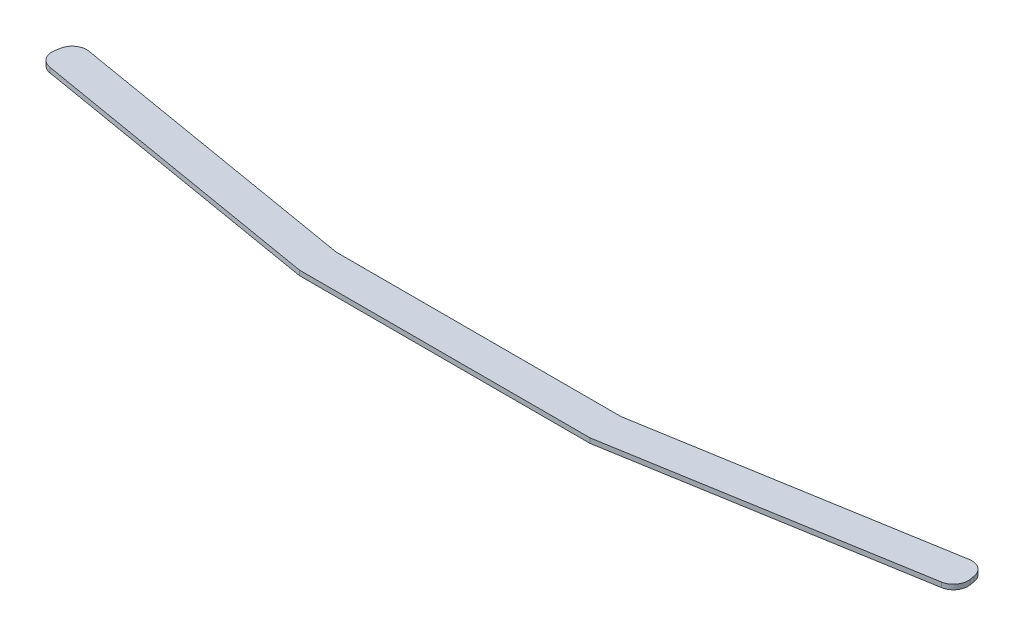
ISO-10303-21;
HEADER;
FILE_DESCRIPTION(('STEP AP214'),'2;1');
FILE_NAME('part.step','',(''),(''),'','','');
FILE_SCHEMA(('AUTOMOTIVE_DESIGN { 1 0 10303 214 1 1 1 1 }'));
ENDSEC;
DATA;
#1=APPLICATION_CONTEXT('core data for automotive mechanical design processes');
#2=APPLICATION_PROTOCOL_DEFINITION('international standard','automotive_design',2000,#1);
#3=PRODUCT_CONTEXT('',#1,'mechanical');
#4=PRODUCT('Part','Part','',(#3));
#5=PRODUCT_RELATED_PRODUCT_CATEGORY('part','',(#4));
#6=PRODUCT_DEFINITION_FORMATION('','',#4);
#7=PRODUCT_DEFINITION_CONTEXT('part definition',#1,'design');
#8=PRODUCT_DEFINITION('design','',#6,#7);
#9=PRODUCT_DEFINITION_SHAPE('','',#8);
#10=(LENGTH_UNIT() NAMED_UNIT(*) SI_UNIT(.MILLI.,.METRE.));
#11=(NAMED_UNIT(*) PLANE_ANGLE_UNIT() SI_UNIT($,.RADIAN.));
#12=(NAMED_UNIT(*) SI_UNIT($,.STERADIAN.) SOLID_ANGLE_UNIT());
#13=UNCERTAINTY_MEASURE_WITH_UNIT(LENGTH_MEASURE(1.E-05),#10,'distance_accuracy_value','');
#14=(GEOMETRIC_REPRESENTATION_CONTEXT(3) GLOBAL_UNCERTAINTY_ASSIGNED_CONTEXT((#13)) GLOBAL_UNIT_ASSIGNED_CONTEXT((#10,
#11,#12)) REPRESENTATION_CONTEXT('',''));
#15=CARTESIAN_POINT('',(0.,0.,0.));
#16=DIRECTION('',(0.,0.,1.));
#17=DIRECTION('',(1.,0.,0.));
#18=AXIS2_PLACEMENT_3D('',#15,#16,#17);
#19=CARTESIAN_POINT('',(29.9999999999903,1.,0.));
#20=DIRECTION('',(-0.166858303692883,0.,-0.985980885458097));
#21=DIRECTION('',(-0.985980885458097,0.,0.166858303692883));
#22=AXIS2_PLACEMENT_3D('',#19,#20,#21);
#23=PLANE('',#22);
#24=DIRECTION('',(0.985980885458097,0.,-0.166858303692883));
#25=VECTOR('',#24,1.);
#26=CARTESIAN_POINT('',(29.9999999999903,0.,0.));
#27=LINE('',#26,#25);
#28=CARTESIAN_POINT('',(29.9999999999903,0.,0.));
#29=VERTEX_POINT('',#28);
#30=CARTESIAN_POINT('',(92.0420573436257,0.,-10.4994250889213));
#31=VERTEX_POINT('',#30);
#32=EDGE_CURVE('E153',#29,#31,#27,.T.);
#33=ORIENTED_EDGE('',*,*,#32,.T.);
#34=DIRECTION('',(0.,-1.,0.));
#35=VECTOR('',#34,1.);
#36=CARTESIAN_POINT('',(92.0420573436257,1.,-10.4994250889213));
#37=LINE('',#36,#35);
#38=CARTESIAN_POINT('',(92.0420573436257,1.,-10.4994250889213));
#39=VERTEX_POINT('',#38);
#40=EDGE_CURVE('E11',#39,#31,#37,.T.);
#41=ORIENTED_EDGE('',*,*,#40,.F.);
#42=DIRECTION('',(0.985980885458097,0.,-0.166858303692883));
#43=VECTOR('',#42,1.);
#44=CARTESIAN_POINT('',(29.9999999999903,1.,0.));
#45=LINE('',#44,#43);
#46=CARTESIAN_POINT('',(29.9999999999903,1.,0.));
#47=VERTEX_POINT('',#46);
#48=EDGE_CURVE('E175',#47,#39,#45,.T.);
#49=ORIENTED_EDGE('',*,*,#48,.F.);
#50=DIRECTION('',(0.,-1.,0.));
#51=VECTOR('',#50,1.);
#52=CARTESIAN_POINT('',(29.9999999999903,1.,0.));
#53=LINE('',#52,#51);
#54=EDGE_CURVE('E149',#47,#29,#53,.T.);
#55=ORIENTED_EDGE('',*,*,#54,.T.);
#56=EDGE_LOOP('',(#33,#41,#49,#55));
#57=FACE_BOUND('',#56,.T.);
#58=ADVANCED_FACE('F33',(#57),#23,.F.);
#59=CARTESIAN_POINT('',(91.541482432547,1.,-13.4573677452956));
#60=DIRECTION('',(0.,-1.,0.));
#61=DIRECTION('',(0.,0.,-1.));
#62=AXIS2_PLACEMENT_3D('',#59,#60,#61);
#63=CYLINDRICAL_SURFACE('',#62,2.99999999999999);
#64=CARTESIAN_POINT('',(91.541482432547,0.,-13.4573677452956));
#65=DIRECTION('',(0.,1.,0.));
#66=DIRECTION('',(0.,0.,1.));
#67=AXIS2_PLACEMENT_3D('',#64,#65,#66);
#68=CIRCLE('',#67,2.99999999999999);
#69=CARTESIAN_POINT('',(94.4994250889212,0.,-13.9579426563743));
#70=VERTEX_POINT('',#69);
#71=EDGE_CURVE('E156',#31,#70,#68,.T.);
#72=ORIENTED_EDGE('',*,*,#71,.T.);
#73=DIRECTION('',(0.,-1.,0.));
#74=VECTOR('',#73,1.);
#75=CARTESIAN_POINT('',(94.4994250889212,1.,-13.9579426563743));
#76=LINE('',#75,#74);
#77=CARTESIAN_POINT('',(94.4994250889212,1.,-13.9579426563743));
#78=VERTEX_POINT('',#77);
#79=EDGE_CURVE('E41',#78,#70,#76,.T.);
#80=ORIENTED_EDGE('',*,*,#79,.F.);
#81=CARTESIAN_POINT('',(91.541482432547,1.,-13.4573677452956));
#82=DIRECTION('',(0.,1.,0.));
#83=DIRECTION('',(0.,0.,1.));
#84=AXIS2_PLACEMENT_3D('',#81,#82,#83);
#85=CIRCLE('',#84,2.99999999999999);
#86=EDGE_CURVE('E104',#39,#78,#85,.T.);
#87=ORIENTED_EDGE('',*,*,#86,.F.);
#88=ORIENTED_EDGE('',*,*,#40,.T.);
#89=EDGE_LOOP('',(#72,#80,#87,#88));
#90=FACE_BOUND('',#89,.T.);
#91=ADVANCED_FACE('F253',(#90),#63,.T.);
#92=CARTESIAN_POINT('',(94.4994250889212,1.,-13.9579426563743));
#93=DIRECTION('',(-0.985980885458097,0.,0.166858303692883));
#94=DIRECTION('',(0.166858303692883,0.,0.985980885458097));
#95=AXIS2_PLACEMENT_3D('',#92,#93,#94);
#96=PLANE('',#95);
#97=DIRECTION('',(-0.166858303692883,0.,-0.985980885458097));
#98=VECTOR('',#97,1.);
#99=CARTESIAN_POINT('',(94.4994250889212,0.,-13.9579426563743));
#100=LINE('',#99,#98);
#101=CARTESIAN_POINT('',(94.3325667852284,0.,-14.9439235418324));
#102=VERTEX_POINT('',#101);
#103=EDGE_CURVE('E158',#70,#102,#100,.T.);
#104=ORIENTED_EDGE('',*,*,#103,.T.);
#105=DIRECTION('',(0.,-1.,0.));
#106=VECTOR('',#105,1.);
#107=CARTESIAN_POINT('',(94.3325667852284,1.,-14.9439235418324));
#108=LINE('',#107,#106);
#109=CARTESIAN_POINT('',(94.3325667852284,1.,-14.9439235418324));
#110=VERTEX_POINT('',#109);
#111=EDGE_CURVE('E194',#110,#102,#108,.T.);
#112=ORIENTED_EDGE('',*,*,#111,.F.);
#113=DIRECTION('',(-0.166858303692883,0.,-0.985980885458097));
#114=VECTOR('',#113,1.);
#115=CARTESIAN_POINT('',(94.4994250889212,1.,-13.9579426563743));
#116=LINE('',#115,#114);
#117=EDGE_CURVE('E202',#78,#110,#116,.T.);
#118=ORIENTED_EDGE('',*,*,#117,.F.);
#119=ORIENTED_EDGE('',*,*,#79,.T.);
#120=EDGE_LOOP('',(#104,#112,#118,#119));
#121=FACE_BOUND('',#120,.T.);
#122=ADVANCED_FACE('F200',(#121),#96,.F.);
#123=CARTESIAN_POINT('',(91.3746241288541,1.,-14.4433486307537));
#124=DIRECTION('',(0.,-1.,0.));
#125=DIRECTION('',(0.,0.,-1.));
#126=AXIS2_PLACEMENT_3D('',#123,#124,#125);
#127=CYLINDRICAL_SURFACE('',#126,3.);
#128=CARTESIAN_POINT('',(91.3746241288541,0.,-14.4433486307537));
#129=DIRECTION('',(0.,1.,0.));
#130=DIRECTION('',(0.,0.,1.));
#131=AXIS2_PLACEMENT_3D('',#128,#129,#130);
#132=CIRCLE('',#131,3.);
#133=CARTESIAN_POINT('',(90.8740492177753,0.,-17.4012912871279));
#134=VERTEX_POINT('',#133);
#135=EDGE_CURVE('E160',#102,#134,#132,.T.);
#136=ORIENTED_EDGE('',*,*,#135,.T.);
#137=DIRECTION('',(0.,-1.,0.));
#138=VECTOR('',#137,1.);
#139=CARTESIAN_POINT('',(90.8740492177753,1.,-17.4012912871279));
#140=LINE('',#139,#138);
#141=CARTESIAN_POINT('',(90.8740492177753,1.,-17.4012912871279));
#142=VERTEX_POINT('',#141);
#143=EDGE_CURVE('E191',#142,#134,#140,.T.);
#144=ORIENTED_EDGE('',*,*,#143,.F.);
#145=CARTESIAN_POINT('',(91.3746241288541,1.,-14.4433486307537));
#146=DIRECTION('',(0.,1.,0.));
#147=DIRECTION('',(0.,0.,1.));
#148=AXIS2_PLACEMENT_3D('',#145,#146,#147);
#149=CIRCLE('',#148,3.);
#150=EDGE_CURVE('E220',#110,#142,#149,.T.);
#151=ORIENTED_EDGE('',*,*,#150,.F.);
#152=ORIENTED_EDGE('',*,*,#111,.T.);
#153=EDGE_LOOP('',(#136,#144,#151,#152));
#154=FACE_BOUND('',#153,.T.);
#155=ADVANCED_FACE('F211',(#154),#127,.T.);
#156=CARTESIAN_POINT('',(29.4118734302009,1.,-7.00000000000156));
#157=DIRECTION('',(0.166858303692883,0.,0.985980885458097));
#158=DIRECTION('',(0.985980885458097,0.,-0.166858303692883));
#159=AXIS2_PLACEMENT_3D('',#156,#157,#158);
#160=PLANE('',#159);
#161=DIRECTION('',(-0.985980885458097,0.,0.166858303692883));
#162=VECTOR('',#161,1.);
#163=CARTESIAN_POINT('',(29.4118734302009,0.,-7.00000000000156));
#164=LINE('',#163,#162);
#165=CARTESIAN_POINT('',(29.4118734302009,0.,-7.00000000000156));
#166=VERTEX_POINT('',#165);
#167=EDGE_CURVE('E162',#134,#166,#164,.T.);
#168=ORIENTED_EDGE('',*,*,#167,.T.);
#169=DIRECTION('',(0.,-1.,0.));
#170=VECTOR('',#169,1.);
#171=CARTESIAN_POINT('',(29.4118734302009,1.,-7.00000000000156));
#172=LINE('',#171,#170);
#173=CARTESIAN_POINT('',(29.4118734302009,1.,-7.00000000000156));
#174=VERTEX_POINT('',#173);
#175=EDGE_CURVE('E188',#174,#166,#172,.T.);
#176=ORIENTED_EDGE('',*,*,#175,.F.);
#177=DIRECTION('',(-0.985980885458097,0.,0.166858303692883));
#178=VECTOR('',#177,1.);
#179=CARTESIAN_POINT('',(29.4118734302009,1.,-7.00000000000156));
#180=LINE('',#179,#178);
#181=EDGE_CURVE('E217',#142,#174,#180,.T.);
#182=ORIENTED_EDGE('',*,*,#181,.F.);
#183=ORIENTED_EDGE('',*,*,#143,.T.);
#184=EDGE_LOOP('',(#168,#176,#182,#183));
#185=FACE_BOUND('',#184,.T.);
#186=ADVANCED_FACE('F215',(#185),#160,.F.);
#187=CARTESIAN_POINT('',(-29.4118734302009,1.,-7.00000000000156));
#188=DIRECTION('',(0.,0.,1.));
#189=DIRECTION('',(1.,0.,0.));
#190=AXIS2_PLACEMENT_3D('',#187,#188,#189);
#191=PLANE('',#190);
#192=DIRECTION('',(-1.,0.,0.));
#193=VECTOR('',#192,1.);
#194=CARTESIAN_POINT('',(-29.4118734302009,0.,-7.00000000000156));
#195=LINE('',#194,#193);
#196=CARTESIAN_POINT('',(-29.4118734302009,0.,-7.00000000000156));
#197=VERTEX_POINT('',#196);
#198=EDGE_CURVE('E164',#166,#197,#195,.T.);
#199=ORIENTED_EDGE('',*,*,#198,.T.);
#200=DIRECTION('',(0.,-1.,0.));
#201=VECTOR('',#200,1.);
#202=CARTESIAN_POINT('',(-29.4118734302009,1.,-7.00000000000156));
#203=LINE('',#202,#201);
#204=CARTESIAN_POINT('',(-29.4118734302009,1.,-7.00000000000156));
#205=VERTEX_POINT('',#204);
#206=EDGE_CURVE('E185',#205,#197,#203,.T.);
#207=ORIENTED_EDGE('',*,*,#206,.F.);
#208=DIRECTION('',(-1.,0.,0.));
#209=VECTOR('',#208,1.);
#210=CARTESIAN_POINT('',(-29.4118734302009,1.,-7.00000000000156));
#211=LINE('',#210,#209);
#212=EDGE_CURVE('E219',#174,#205,#211,.T.);
#213=ORIENTED_EDGE('',*,*,#212,.F.);
#214=ORIENTED_EDGE('',*,*,#175,.T.);
#215=EDGE_LOOP('',(#199,#207,#213,#214));
#216=FACE_BOUND('',#215,.T.);
#217=ADVANCED_FACE('F266',(#216),#191,.F.);
#218=CARTESIAN_POINT('',(-29.4118734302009,1.,-7.00000000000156));
#219=DIRECTION('',(-0.166858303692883,0.,0.985980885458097));
#220=DIRECTION('',(0.985980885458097,0.,0.166858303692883));
#221=AXIS2_PLACEMENT_3D('',#218,#219,#220);
#222=PLANE('',#221);
#223=DIRECTION('',(-0.985980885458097,0.,-0.166858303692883));
#224=VECTOR('',#223,1.);
#225=CARTESIAN_POINT('',(-29.4118734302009,0.,-7.00000000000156));
#226=LINE('',#225,#224);
#227=CARTESIAN_POINT('',(-90.8740492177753,0.,-17.4012912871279));
#228=VERTEX_POINT('',#227);
#229=EDGE_CURVE('E166',#197,#228,#226,.T.);
#230=ORIENTED_EDGE('',*,*,#229,.T.);
#231=DIRECTION('',(0.,-1.,0.));
#232=VECTOR('',#231,1.);
#233=CARTESIAN_POINT('',(-90.8740492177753,1.,-17.4012912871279));
#234=LINE('',#233,#232);
#235=CARTESIAN_POINT('',(-90.8740492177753,1.,-17.4012912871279));
#236=VERTEX_POINT('',#235);
#237=EDGE_CURVE('E182',#236,#228,#234,.T.);
#238=ORIENTED_EDGE('',*,*,#237,.F.);
#239=DIRECTION('',(-0.985980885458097,0.,-0.166858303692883));
#240=VECTOR('',#239,1.);
#241=CARTESIAN_POINT('',(-29.4118734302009,1.,-7.00000000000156));
#242=LINE('',#241,#240);
#243=EDGE_CURVE('E222',#205,#236,#242,.T.);
#244=ORIENTED_EDGE('',*,*,#243,.F.);
#245=ORIENTED_EDGE('',*,*,#206,.T.);
#246=EDGE_LOOP('',(#230,#238,#244,#245));
#247=FACE_BOUND('',#246,.T.);
#248=ADVANCED_FACE('F269',(#247),#222,.F.);
#249=CARTESIAN_POINT('',(-91.3746241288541,1.,-14.4433486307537));
#250=DIRECTION('',(0.,-1.,0.));
#251=DIRECTION('',(0.,0.,-1.));
#252=AXIS2_PLACEMENT_3D('',#249,#250,#251);
#253=CYLINDRICAL_SURFACE('',#252,3.);
#254=CARTESIAN_POINT('',(-91.3746241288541,0.,-14.4433486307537));
#255=DIRECTION('',(0.,1.,0.));
#256=DIRECTION('',(0.,0.,-1.));
#257=AXIS2_PLACEMENT_3D('',#254,#255,#256);
#258=CIRCLE('',#257,3.);
#259=CARTESIAN_POINT('',(-94.3325667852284,0.,-14.9439235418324));
#260=VERTEX_POINT('',#259);
#261=EDGE_CURVE('E168',#228,#260,#258,.T.);
#262=ORIENTED_EDGE('',*,*,#261,.T.);
#263=DIRECTION('',(0.,-1.,0.));
#264=VECTOR('',#263,1.);
#265=CARTESIAN_POINT('',(-94.3325667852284,1.,-14.9439235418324));
#266=LINE('',#265,#264);
#267=CARTESIAN_POINT('',(-94.3325667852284,1.,-14.9439235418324));
#268=VERTEX_POINT('',#267);
#269=EDGE_CURVE('E179',#268,#260,#266,.T.);
#270=ORIENTED_EDGE('',*,*,#269,.F.);
#271=CARTESIAN_POINT('',(-91.3746241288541,1.,-14.4433486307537));
#272=DIRECTION('',(0.,1.,0.));
#273=DIRECTION('',(0.,0.,-1.));
#274=AXIS2_PLACEMENT_3D('',#271,#272,#273);
#275=CIRCLE('',#274,3.);
#276=EDGE_CURVE('E228',#236,#268,#275,.T.);
#277=ORIENTED_EDGE('',*,*,#276,.F.);
#278=ORIENTED_EDGE('',*,*,#237,.T.);
#279=EDGE_LOOP('',(#262,#270,#277,#278));
#280=FACE_BOUND('',#279,.T.);
#281=ADVANCED_FACE('F234',(#280),#253,.T.);
#282=CARTESIAN_POINT('',(-94.4994250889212,1.,-13.9579426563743));
#283=DIRECTION('',(0.985980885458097,0.,0.166858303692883));
#284=DIRECTION('',(0.166858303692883,0.,-0.985980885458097));
#285=AXIS2_PLACEMENT_3D('',#282,#283,#284);
#286=PLANE('',#285);
#287=DIRECTION('',(-0.166858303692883,0.,0.985980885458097));
#288=VECTOR('',#287,1.);
#289=CARTESIAN_POINT('',(-94.4994250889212,0.,-13.9579426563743));
#290=LINE('',#289,#288);
#291=CARTESIAN_POINT('',(-94.4994250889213,0.,-13.9579426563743));
#292=VERTEX_POINT('',#291);
#293=EDGE_CURVE('E170',#260,#292,#290,.T.);
#294=ORIENTED_EDGE('',*,*,#293,.T.);
#295=DIRECTION('',(0.,-1.,0.));
#296=VECTOR('',#295,1.);
#297=CARTESIAN_POINT('',(-94.4994250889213,1.,-13.9579426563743));
#298=LINE('',#297,#296);
#299=CARTESIAN_POINT('',(-94.4994250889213,1.,-13.9579426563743));
#300=VERTEX_POINT('',#299);
#301=EDGE_CURVE('E144',#300,#292,#298,.T.);
#302=ORIENTED_EDGE('',*,*,#301,.F.);
#303=DIRECTION('',(-0.166858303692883,0.,0.985980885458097));
#304=VECTOR('',#303,1.);
#305=CARTESIAN_POINT('',(-94.4994250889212,1.,-13.9579426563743));
#306=LINE('',#305,#304);
#307=EDGE_CURVE('E135',#268,#300,#306,.T.);
#308=ORIENTED_EDGE('',*,*,#307,.F.);
#309=ORIENTED_EDGE('',*,*,#269,.T.);
#310=EDGE_LOOP('',(#294,#302,#308,#309));
#311=FACE_BOUND('',#310,.T.);
#312=ADVANCED_FACE('F238',(#311),#286,.F.);
#313=CARTESIAN_POINT('',(-91.541482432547,1.,-13.4573677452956));
#314=DIRECTION('',(0.,-1.,0.));
#315=DIRECTION('',(0.,0.,-1.));
#316=AXIS2_PLACEMENT_3D('',#313,#314,#315);
#317=CYLINDRICAL_SURFACE('',#316,2.99999999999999);
#318=CARTESIAN_POINT('',(-91.541482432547,0.,-13.4573677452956));
#319=DIRECTION('',(0.,1.,0.));
#320=DIRECTION('',(0.,0.,-1.));
#321=AXIS2_PLACEMENT_3D('',#318,#319,#320);
#322=CIRCLE('',#321,2.99999999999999);
#323=CARTESIAN_POINT('',(-92.0420573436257,0.,-10.4994250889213));
#324=VERTEX_POINT('',#323);
#325=EDGE_CURVE('E143',#292,#324,#322,.T.);
#326=ORIENTED_EDGE('',*,*,#325,.T.);
#327=DIRECTION('',(0.,-1.,0.));
#328=VECTOR('',#327,1.);
#329=CARTESIAN_POINT('',(-92.0420573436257,1.,-10.4994250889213));
#330=LINE('',#329,#328);
#331=CARTESIAN_POINT('',(-92.0420573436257,1.,-10.4994250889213));
#332=VERTEX_POINT('',#331);
#333=EDGE_CURVE('E140',#332,#324,#330,.T.);
#334=ORIENTED_EDGE('',*,*,#333,.F.);
#335=CARTESIAN_POINT('',(-91.541482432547,1.,-13.4573677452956));
#336=DIRECTION('',(0.,1.,0.));
#337=DIRECTION('',(0.,0.,-1.));
#338=AXIS2_PLACEMENT_3D('',#335,#336,#337);
#339=CIRCLE('',#338,2.99999999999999);
#340=EDGE_CURVE('E129',#300,#332,#339,.T.);
#341=ORIENTED_EDGE('',*,*,#340,.F.);
#342=ORIENTED_EDGE('',*,*,#301,.T.);
#343=EDGE_LOOP('',(#326,#334,#341,#342));
#344=FACE_BOUND('',#343,.T.);
#345=ADVANCED_FACE('F141',(#344),#317,.T.);
#346=CARTESIAN_POINT('',(-29.9999999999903,1.,0.));
#347=DIRECTION('',(0.166858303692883,0.,-0.985980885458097));
#348=DIRECTION('',(-0.985980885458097,0.,-0.166858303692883));
#349=AXIS2_PLACEMENT_3D('',#346,#347,#348);
#350=PLANE('',#349);
#351=DIRECTION('',(0.985980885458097,0.,0.166858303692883));
#352=VECTOR('',#351,1.);
#353=CARTESIAN_POINT('',(-29.9999999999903,0.,0.));
#354=LINE('',#353,#352);
#355=CARTESIAN_POINT('',(-29.9999999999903,0.,0.));
#356=VERTEX_POINT('',#355);
#357=EDGE_CURVE('E90',#324,#356,#354,.T.);
#358=ORIENTED_EDGE('',*,*,#357,.T.);
#359=DIRECTION('',(0.,-1.,0.));
#360=VECTOR('',#359,1.);
#361=CARTESIAN_POINT('',(-29.9999999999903,1.,0.));
#362=LINE('',#361,#360);
#363=CARTESIAN_POINT('',(-29.9999999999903,1.,0.));
#364=VERTEX_POINT('',#363);
#365=EDGE_CURVE('E145',#364,#356,#362,.T.);
#366=ORIENTED_EDGE('',*,*,#365,.F.);
#367=DIRECTION('',(0.985980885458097,0.,0.166858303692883));
#368=VECTOR('',#367,1.);
#369=CARTESIAN_POINT('',(-29.9999999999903,1.,0.));
#370=LINE('',#369,#368);
#371=EDGE_CURVE('E133',#332,#364,#370,.T.);
#372=ORIENTED_EDGE('',*,*,#371,.F.);
#373=ORIENTED_EDGE('',*,*,#333,.T.);
#374=EDGE_LOOP('',(#358,#366,#372,#373));
#375=FACE_BOUND('',#374,.T.);
#376=ADVANCED_FACE('F147',(#375),#350,.F.);
#377=CARTESIAN_POINT('',(-29.9999999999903,1.,0.));
#378=DIRECTION('',(0.,0.,-1.));
#379=DIRECTION('',(-1.,0.,0.));
#380=AXIS2_PLACEMENT_3D('',#377,#378,#379);
#381=PLANE('',#380);
#382=DIRECTION('',(1.,0.,0.));
#383=VECTOR('',#382,1.);
#384=CARTESIAN_POINT('',(-29.9999999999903,0.,0.));
#385=LINE('',#384,#383);
#386=EDGE_CURVE('E96',#356,#29,#385,.T.);
#387=ORIENTED_EDGE('',*,*,#386,.T.);
#388=ORIENTED_EDGE('',*,*,#54,.F.);
#389=DIRECTION('',(1.,0.,0.));
#390=VECTOR('',#389,1.);
#391=CARTESIAN_POINT('',(-29.9999999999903,1.,0.));
#392=LINE('',#391,#390);
#393=EDGE_CURVE('E49',#364,#47,#392,.T.);
#394=ORIENTED_EDGE('',*,*,#393,.F.);
#395=ORIENTED_EDGE('',*,*,#365,.T.);
#396=EDGE_LOOP('',(#387,#388,#394,#395));
#397=FACE_BOUND('',#396,.T.);
#398=ADVANCED_FACE('F242',(#397),#381,.F.);
#399=CARTESIAN_POINT('',(91.541482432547,1.,-13.4573677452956));
#400=DIRECTION('',(0.,1.,0.));
#401=DIRECTION('',(0.,0.,1.));
#402=AXIS2_PLACEMENT_3D('',#399,#400,#401);
#403=PLANE('',#402);
#404=ORIENTED_EDGE('',*,*,#48,.T.);
#405=ORIENTED_EDGE('',*,*,#86,.T.);
#406=ORIENTED_EDGE('',*,*,#117,.T.);
#407=ORIENTED_EDGE('',*,*,#150,.T.);
#408=ORIENTED_EDGE('',*,*,#181,.T.);
#409=ORIENTED_EDGE('',*,*,#212,.T.);
#410=ORIENTED_EDGE('',*,*,#243,.T.);
#411=ORIENTED_EDGE('',*,*,#276,.T.);
#412=ORIENTED_EDGE('',*,*,#307,.T.);
#413=ORIENTED_EDGE('',*,*,#340,.T.);
#414=ORIENTED_EDGE('',*,*,#371,.T.);
#415=ORIENTED_EDGE('',*,*,#393,.T.);
#416=EDGE_LOOP('',(#404,#405,#406,#407,#408,#409,#410,#411,#412,#413,#414,#415));
#417=FACE_BOUND('',#416,.T.);
#418=ADVANCED_FACE('F131',(#417),#403,.T.);
#419=CARTESIAN_POINT('',(91.541482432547,0.,-13.4573677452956));
#420=DIRECTION('',(0.,1.,0.));
#421=DIRECTION('',(0.,0.,1.));
#422=AXIS2_PLACEMENT_3D('',#419,#420,#421);
#423=PLANE('',#422);
#424=ORIENTED_EDGE('',*,*,#32,.F.);
#425=ORIENTED_EDGE('',*,*,#386,.F.);
#426=ORIENTED_EDGE('',*,*,#357,.F.);
#427=ORIENTED_EDGE('',*,*,#325,.F.);
#428=ORIENTED_EDGE('',*,*,#293,.F.);
#429=ORIENTED_EDGE('',*,*,#261,.F.);
#430=ORIENTED_EDGE('',*,*,#229,.F.);
#431=ORIENTED_EDGE('',*,*,#198,.F.);
#432=ORIENTED_EDGE('',*,*,#167,.F.);
#433=ORIENTED_EDGE('',*,*,#135,.F.);
#434=ORIENTED_EDGE('',*,*,#103,.F.);
#435=ORIENTED_EDGE('',*,*,#71,.F.);
#436=EDGE_LOOP('',(#424,#425,#426,#427,#428,#429,#430,#431,#432,#433,#434,#435));
#437=FACE_BOUND('',#436,.T.);
#438=ADVANCED_FACE('F206',(#437),#423,.F.);
#439=CLOSED_SHELL('',(#58,#91,#122,#155,#186,#217,#248,#281,#312,#345,#376,#398,#418,#438));
#440=MANIFOLD_SOLID_BREP('B2',#439);
#441=ADVANCED_BREP_SHAPE_REPRESENTATION('',(#18,#440),#14);
#442=SHAPE_DEFINITION_REPRESENTATION(#9,#441);
ENDSEC;
END-ISO-10303-21;
